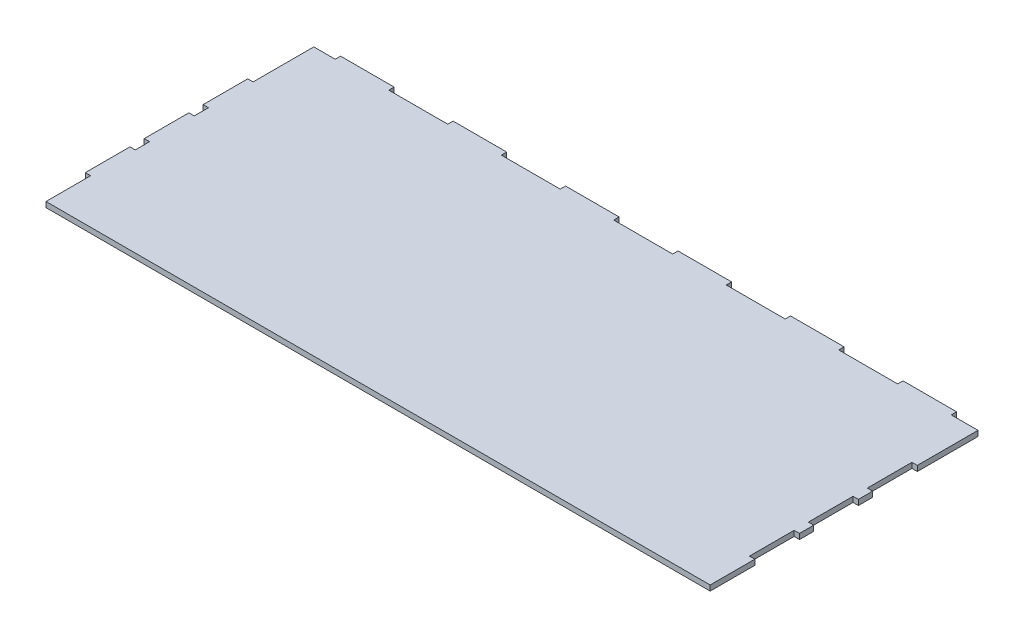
from build123d import *

# Parameters (mm, degrees)
SKETCH1_W           = 248
SKETCH1_H           = 2
BOSS_EXTRUDE1_DEPTH = 100
SKETCH2_W           = 16.666666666
SKETCH2_H           = 2
BOSS_EXTRUDE2_DEPTH = 2
LPATTERN1_COUNT     = 3
LPATTERN1_PITCH     = 22
SKETCH3_W           = 16.666666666
SKETCH3_H           = 2
CUT_EXTRUDE1_DEPTH  = 2
SKETCH4_W           = 20
SKETCH4_H           = 2
BOSS_EXTRUDE3_DEPTH = 2
LPATTERN2_COUNT     = 6
LPATTERN2_PITCH     = 42


with BuildPart() as part:
    # Sketch1 → Boss-Extrude1 (new body)
    with BuildSketch(Plane.XY):
        with Locations((1, 124)):
            Rectangle(SKETCH1_W, SKETCH1_H)
    extrude(amount=BOSS_EXTRUDE1_DEPTH)

    # Sketch2 → Boss-Extrude2 (add)
    with BuildSketch(Plane.ZY.offset(123)):
        with Locations((75, 124)):
            Rectangle(SKETCH2_W, SKETCH2_H)
    boss_extrude2 = extrude(amount=BOSS_EXTRUDE2_DEPTH)

    # LPattern1: Boss-Extrude2 ×3
    with Locations(*[(0, 0, -i * LPATTERN1_PITCH) for i in range(1, LPATTERN1_COUNT)]):
        add(boss_extrude2)

    # Sketch3 → Cut-Extrude1 (cut)
    with BuildSketch(Plane(origin=(125, 0, 0), x_dir=(0, 0, -1), z_dir=(1, 0, 0))):
        with Locations((-31, 124)):
            Rectangle(SKETCH3_W, SKETCH3_H)
        with Locations((-53, 124)):
            Rectangle(SKETCH3_W, SKETCH3_H)
        with Locations((-75, 124)):
            Rectangle(SKETCH3_W, SKETCH3_H)
    extrude(amount=-CUT_EXTRUDE1_DEPTH, mode=Mode.SUBTRACT)

    # Sketch4 → Boss-Extrude3 (add)
    with BuildSketch(Plane(origin=(0, 0, 0), x_dir=(-1, 0, 0), z_dir=(0, 0, -1))):
        with Locations((-105, 124)):
            Rectangle(SKETCH4_W, SKETCH4_H)
    boss_extrude3 = extrude(amount=BOSS_EXTRUDE3_DEPTH)

    # LPattern2: Boss-Extrude3 ×6
    with Locations(*[(-i * LPATTERN2_PITCH, 0, 0) for i in range(1, LPATTERN2_COUNT)]):
        add(boss_extrude3)


solid = part.part
